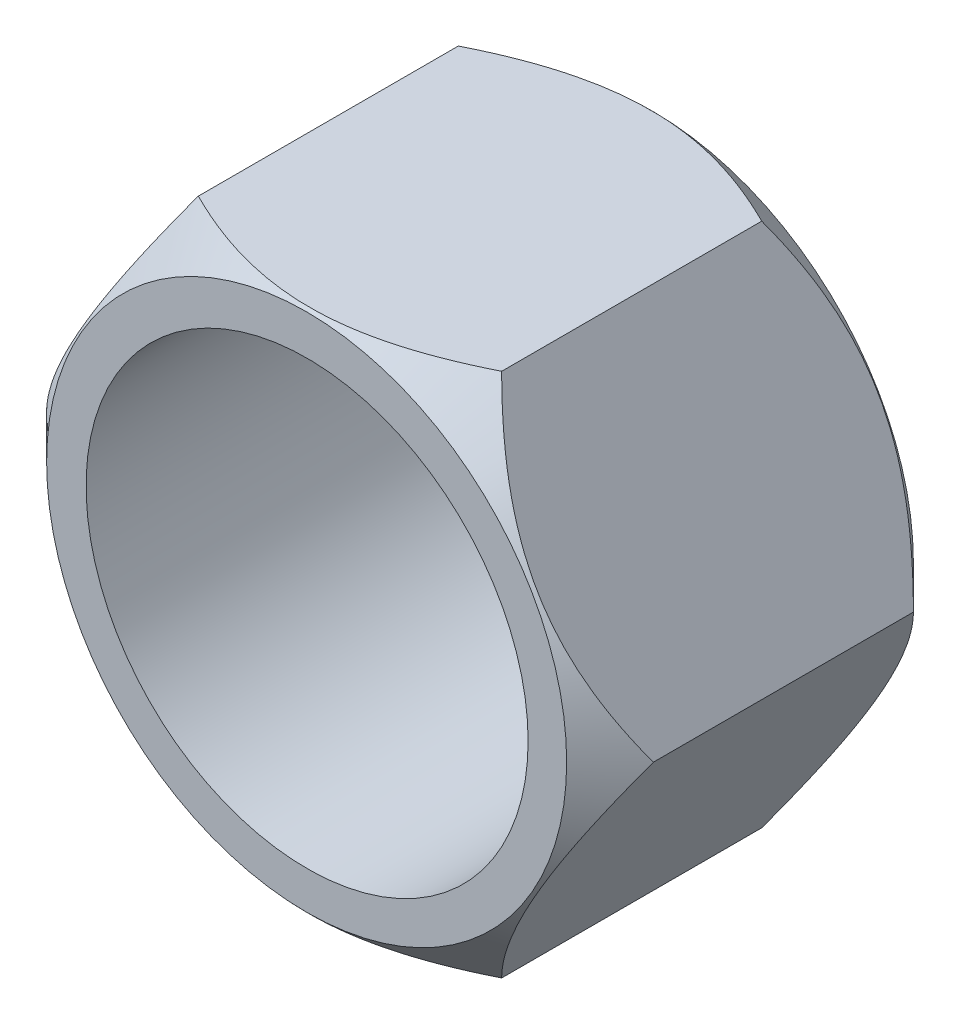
from build123d import *

# Parameters (mm, degrees)
ESQUISSE1_R             = 9
EXTRUSION1_DEPTH        = 8
TROU_TARAUD_M121_D      = 10.2
CHANFREIN1_SIZE         = 3
ESQUISSE4_OUTSIDE_W     = 25.336
ESQUISSE4_OUTSIDE_H     = 25.336
ENL_V_MAT_EXTRU_1_DEPTH = 10


with BuildPart() as part:
    # Esquisse1 → Extrusion1 (new body)
    with BuildSketch(Plane.XY):
        Circle(ESQUISSE1_R)
    extrude(amount=EXTRUSION1_DEPTH)

    # Trou taraud_ M121 (through all)
    with Locations(Plane.XY.offset(8)):
        with Locations((0.010473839, -0.020947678)):
            Hole(TROU_TARAUD_M121_D / 2)

    # Chanfrein1
    chanfrein1_edges = [part.edges().sort_by_distance(p)[0] for p in [
        (-9, 0, 0),
        (-9, 0, 8),
    ]]
    chamfer(chanfrein1_edges, length=CHANFREIN1_SIZE)

    # Esquisse4 outside → Enl_v. mat.-Extru.1 (cut)
    with BuildSketch(Plane.XY.offset(8)):
        Rectangle(ESQUISSE4_OUTSIDE_W, ESQUISSE4_OUTSIDE_H)
        Polygon((7, 0), (3.5, 6.062177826), (-3.5, 6.062177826), (-7, 0), (-3.5, -6.062177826), (3.5, -6.062177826), align=None, mode=Mode.SUBTRACT)
    extrude(amount=-ENL_V_MAT_EXTRU_1_DEPTH, mode=Mode.SUBTRACT)


solid = part.part
